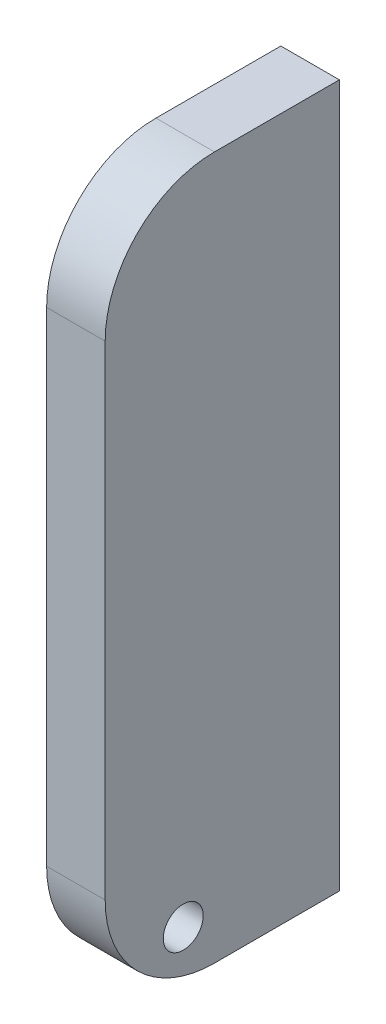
from build123d import *

# Parameters (mm, degrees)
SKETCH1_W           = 9.525
SKETCH1_H           = 114.3
BOSS_EXTRUDE1_DEPTH = 38.1
FILLET1_R           = 17.78
SKETCH2_R           = 3.25
CUT_EXTRUDE1_DEPTH  = 104.028627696


with BuildPart() as part:
    # Sketch1 → Boss-Extrude1 (new body)
    with BuildSketch(Plane.XY):
        with Locations((-113.4875, 38.1)):
            Rectangle(SKETCH1_W, SKETCH1_H)
    extrude(amount=BOSS_EXTRUDE1_DEPTH)

    # Fillet1
    fillet1_edges = [part.edges().sort_by_distance(p)[0] for p in [
        (-113.4875, 95.25, 38.1),
        (-113.4875, -19.05, 38.1),
    ]]
    fillet(fillet1_edges, radius=FILLET1_R)

    # Sketch2 → Cut-Extrude1 (cut, through all)
    with BuildSketch(Plane.ZY.offset(118.25)):
        with Locations((25.4, -11.43)):
            Circle(SKETCH2_R)
    extrude(amount=-CUT_EXTRUDE1_DEPTH, mode=Mode.SUBTRACT)


solid = part.part
